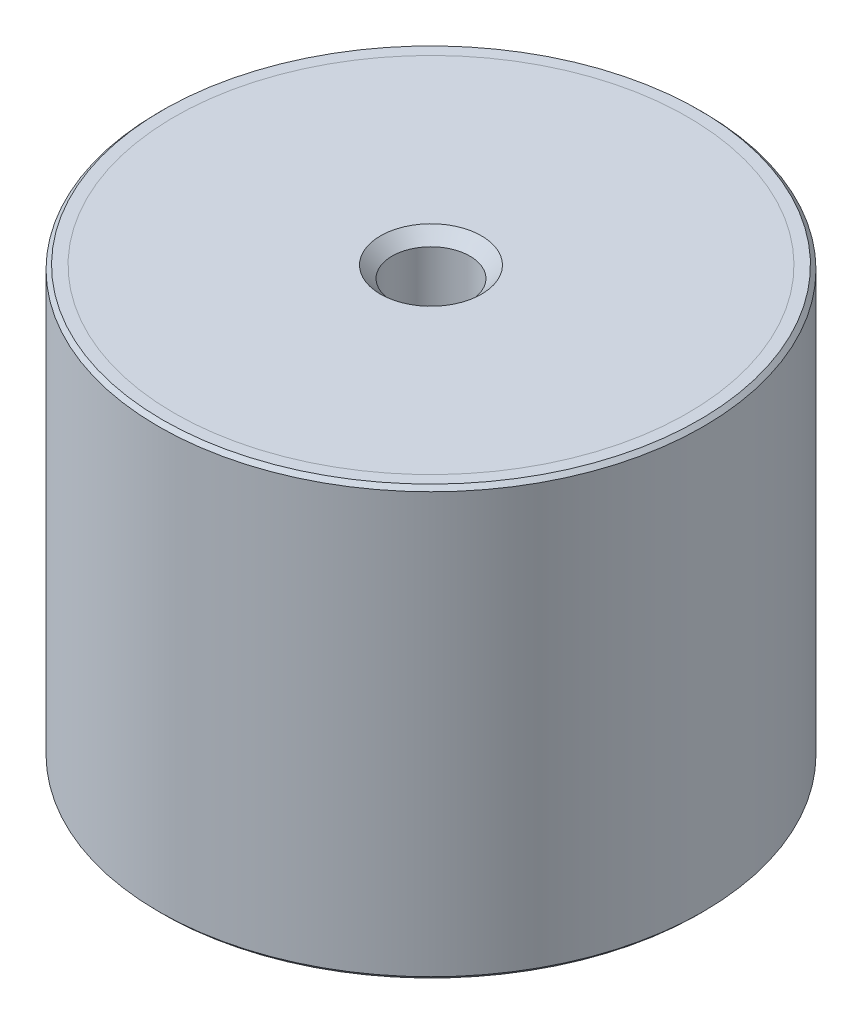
ISO-10303-21;
HEADER;
FILE_DESCRIPTION(('STEP AP214'),'2;1');
FILE_NAME('part.step','',(''),(''),'','','');
FILE_SCHEMA(('AUTOMOTIVE_DESIGN { 1 0 10303 214 1 1 1 1 }'));
ENDSEC;
DATA;
#1=APPLICATION_CONTEXT('core data for automotive mechanical design processes');
#2=APPLICATION_PROTOCOL_DEFINITION('international standard','automotive_design',2000,#1);
#3=PRODUCT_CONTEXT('',#1,'mechanical');
#4=PRODUCT('Part','Part','',(#3));
#5=PRODUCT_RELATED_PRODUCT_CATEGORY('part','',(#4));
#6=PRODUCT_DEFINITION_FORMATION('','',#4);
#7=PRODUCT_DEFINITION_CONTEXT('part definition',#1,'design');
#8=PRODUCT_DEFINITION('design','',#6,#7);
#9=PRODUCT_DEFINITION_SHAPE('','',#8);
#10=(LENGTH_UNIT() NAMED_UNIT(*) SI_UNIT(.MILLI.,.METRE.));
#11=(NAMED_UNIT(*) PLANE_ANGLE_UNIT() SI_UNIT($,.RADIAN.));
#12=(NAMED_UNIT(*) SI_UNIT($,.STERADIAN.) SOLID_ANGLE_UNIT());
#13=UNCERTAINTY_MEASURE_WITH_UNIT(LENGTH_MEASURE(1.E-05),#10,'distance_accuracy_value','');
#14=(GEOMETRIC_REPRESENTATION_CONTEXT(3) GLOBAL_UNCERTAINTY_ASSIGNED_CONTEXT((#13)) GLOBAL_UNIT_ASSIGNED_CONTEXT((#10,
#11,#12)) REPRESENTATION_CONTEXT('',''));
#15=CARTESIAN_POINT('',(0.,0.,0.));
#16=DIRECTION('',(0.,0.,1.));
#17=DIRECTION('',(1.,0.,0.));
#18=AXIS2_PLACEMENT_3D('',#15,#16,#17);
#19=CARTESIAN_POINT('',(0.,-52.,5.));
#20=DIRECTION('',(0.,1.,0.));
#21=DIRECTION('',(0.,0.,1.));
#22=AXIS2_PLACEMENT_3D('',#19,#20,#21);
#23=PLANE('',#22);
#24=CARTESIAN_POINT('',(0.,-52.,0.));
#25=DIRECTION('',(0.,1.,0.));
#26=DIRECTION('',(0.,0.,1.));
#27=AXIS2_PLACEMENT_3D('',#24,#25,#26);
#28=CIRCLE('',#27,33.);
#29=CARTESIAN_POINT('',(0.,-52.,33.));
#30=VERTEX_POINT('',#29);
#31=EDGE_CURVE('P0_E25',#30,#30,#28,.T.);
#32=ORIENTED_EDGE('',*,*,#31,.T.);
#33=EDGE_LOOP('',(#32));
#34=FACE_BOUND('',#33,.T.);
#35=CARTESIAN_POINT('',(0.,-52.,0.));
#36=DIRECTION('',(0.,1.,0.));
#37=DIRECTION('',(0.,0.,1.));
#38=AXIS2_PLACEMENT_3D('',#35,#36,#37);
#39=CIRCLE('',#38,5.);
#40=CARTESIAN_POINT('',(0.,-52.,5.));
#41=VERTEX_POINT('',#40);
#42=EDGE_CURVE('P0_E21',#41,#41,#39,.T.);
#43=ORIENTED_EDGE('',*,*,#42,.F.);
#44=EDGE_LOOP('',(#43));
#45=FACE_BOUND('',#44,.T.);
#46=ADVANCED_FACE('P0_F14',(#34,#45),#23,.T.);
#47=CARTESIAN_POINT('',(0.,16.0340428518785,0.));
#48=DIRECTION('',(0.,1.,0.));
#49=DIRECTION('',(0.,0.,1.));
#50=AXIS2_PLACEMENT_3D('',#47,#48,#49);
#51=CYLINDRICAL_SURFACE('',#50,33.);
#52=CARTESIAN_POINT('',(0.,-53.5,0.));
#53=DIRECTION('',(0.,1.,0.));
#54=DIRECTION('',(0.,0.,1.));
#55=AXIS2_PLACEMENT_3D('',#52,#53,#54);
#56=CIRCLE('',#55,33.);
#57=CARTESIAN_POINT('',(0.,-53.5,33.));
#58=VERTEX_POINT('',#57);
#59=EDGE_CURVE('P0_E29',#58,#58,#56,.T.);
#60=ORIENTED_EDGE('',*,*,#59,.T.);
#61=EDGE_LOOP('',(#60));
#62=FACE_BOUND('',#61,.T.);
#63=ORIENTED_EDGE('',*,*,#31,.F.);
#64=EDGE_LOOP('',(#63));
#65=FACE_BOUND('',#64,.T.);
#66=ADVANCED_FACE('P0_F35',(#62,#65),#51,.T.);
#67=CARTESIAN_POINT('',(0.,-53.5,33.));
#68=DIRECTION('',(0.,-1.,0.));
#69=DIRECTION('',(0.,0.,-1.));
#70=AXIS2_PLACEMENT_3D('',#67,#68,#69);
#71=PLANE('',#70);
#72=CARTESIAN_POINT('',(0.,-53.5,0.));
#73=DIRECTION('',(0.,-1.,0.));
#74=DIRECTION('',(0.,0.,-1.));
#75=AXIS2_PLACEMENT_3D('',#72,#73,#74);
#76=CIRCLE('',#75,6.50000000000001);
#77=CARTESIAN_POINT('',(0.,-53.5,-6.50000000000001));
#78=VERTEX_POINT('',#77);
#79=EDGE_CURVE('P0_E10',#78,#78,#76,.F.);
#80=ORIENTED_EDGE('',*,*,#79,.T.);
#81=EDGE_LOOP('',(#80));
#82=FACE_BOUND('',#81,.T.);
#83=ORIENTED_EDGE('',*,*,#59,.F.);
#84=EDGE_LOOP('',(#83));
#85=FACE_BOUND('',#84,.T.);
#86=ADVANCED_FACE('P0_F38',(#82,#85),#71,.T.);
#87=CARTESIAN_POINT('',(0.,-53.5,0.));
#88=DIRECTION('',(0.,-1.,0.));
#89=DIRECTION('',(0.,0.,-1.));
#90=AXIS2_PLACEMENT_3D('',#87,#88,#89);
#91=CONICAL_SURFACE('',#90,6.50000000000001,0.785398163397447);
#92=ORIENTED_EDGE('',*,*,#42,.T.);
#93=EDGE_LOOP('',(#92));
#94=FACE_BOUND('',#93,.T.);
#95=ORIENTED_EDGE('',*,*,#79,.F.);
#96=EDGE_LOOP('',(#95));
#97=FACE_BOUND('',#96,.T.);
#98=ADVANCED_FACE('P0_F16',(#94,#97),#91,.F.);
#99=CLOSED_SHELL('',(#46,#66,#86,#98));
#100=MANIFOLD_SOLID_BREP('P0_B1',#99);
#101=CARTESIAN_POINT('',(0.,1.5,5.));
#102=DIRECTION('',(0.,1.,0.));
#103=DIRECTION('',(0.,0.,1.));
#104=AXIS2_PLACEMENT_3D('',#101,#102,#103);
#105=PLANE('',#104);
#106=CARTESIAN_POINT('',(0.,1.5,0.));
#107=DIRECTION('',(0.,1.,0.));
#108=DIRECTION('',(0.,0.,1.));
#109=AXIS2_PLACEMENT_3D('',#106,#107,#108);
#110=CIRCLE('',#109,6.50000000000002);
#111=CARTESIAN_POINT('',(0.,1.5,6.50000000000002));
#112=VERTEX_POINT('',#111);
#113=EDGE_CURVE('P1_E10',#112,#112,#110,.F.);
#114=ORIENTED_EDGE('',*,*,#113,.T.);
#115=EDGE_LOOP('',(#114));
#116=FACE_BOUND('',#115,.T.);
#117=CARTESIAN_POINT('',(0.,1.5,0.));
#118=DIRECTION('',(0.,1.,0.));
#119=DIRECTION('',(0.,0.,1.));
#120=AXIS2_PLACEMENT_3D('',#117,#118,#119);
#121=CIRCLE('',#120,33.);
#122=CARTESIAN_POINT('',(0.,1.5,33.));
#123=VERTEX_POINT('',#122);
#124=EDGE_CURVE('P1_E21',#123,#123,#121,.T.);
#125=ORIENTED_EDGE('',*,*,#124,.T.);
#126=EDGE_LOOP('',(#125));
#127=FACE_BOUND('',#126,.T.);
#128=ADVANCED_FACE('P1_F14',(#116,#127),#105,.T.);
#129=CARTESIAN_POINT('',(0.,69.5340428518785,0.));
#130=DIRECTION('',(0.,1.,0.));
#131=DIRECTION('',(0.,0.,1.));
#132=AXIS2_PLACEMENT_3D('',#129,#130,#131);
#133=CYLINDRICAL_SURFACE('',#132,33.);
#134=CARTESIAN_POINT('',(0.,0.,0.));
#135=DIRECTION('',(0.,1.,0.));
#136=DIRECTION('',(0.,0.,1.));
#137=AXIS2_PLACEMENT_3D('',#134,#135,#136);
#138=CIRCLE('',#137,33.);
#139=CARTESIAN_POINT('',(0.,0.,33.));
#140=VERTEX_POINT('',#139);
#141=EDGE_CURVE('P1_E25',#140,#140,#138,.T.);
#142=ORIENTED_EDGE('',*,*,#141,.T.);
#143=EDGE_LOOP('',(#142));
#144=FACE_BOUND('',#143,.T.);
#145=ORIENTED_EDGE('',*,*,#124,.F.);
#146=EDGE_LOOP('',(#145));
#147=FACE_BOUND('',#146,.T.);
#148=ADVANCED_FACE('P1_F44',(#144,#147),#133,.T.);
#149=CARTESIAN_POINT('',(0.,0.,33.));
#150=DIRECTION('',(0.,-1.,0.));
#151=DIRECTION('',(0.,0.,-1.));
#152=AXIS2_PLACEMENT_3D('',#149,#150,#151);
#153=PLANE('',#152);
#154=CARTESIAN_POINT('',(0.,0.,0.));
#155=DIRECTION('',(0.,1.,0.));
#156=DIRECTION('',(0.,0.,1.));
#157=AXIS2_PLACEMENT_3D('',#154,#155,#156);
#158=CIRCLE('',#157,5.);
#159=CARTESIAN_POINT('',(0.,0.,5.));
#160=VERTEX_POINT('',#159);
#161=EDGE_CURVE('P1_E29',#160,#160,#158,.T.);
#162=ORIENTED_EDGE('',*,*,#161,.T.);
#163=EDGE_LOOP('',(#162));
#164=FACE_BOUND('',#163,.T.);
#165=ORIENTED_EDGE('',*,*,#141,.F.);
#166=EDGE_LOOP('',(#165));
#167=FACE_BOUND('',#166,.T.);
#168=ADVANCED_FACE('P1_F35',(#164,#167),#153,.T.);
#169=CARTESIAN_POINT('',(0.,0.,0.));
#170=DIRECTION('',(0.,1.,0.));
#171=DIRECTION('',(0.,0.,1.));
#172=AXIS2_PLACEMENT_3D('',#169,#170,#171);
#173=CONICAL_SURFACE('',#172,5.,0.785398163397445);
#174=ORIENTED_EDGE('',*,*,#113,.F.);
#175=EDGE_LOOP('',(#174));
#176=FACE_BOUND('',#175,.T.);
#177=ORIENTED_EDGE('',*,*,#161,.F.);
#178=EDGE_LOOP('',(#177));
#179=FACE_BOUND('',#178,.T.);
#180=ADVANCED_FACE('P1_F16',(#176,#179),#173,.F.);
#181=CLOSED_SHELL('',(#128,#148,#168,#180));
#182=MANIFOLD_SOLID_BREP('P1_B1',#181);
#183=CARTESIAN_POINT('',(0.,0.,0.));
#184=DIRECTION('',(0.,1.,0.));
#185=DIRECTION('',(0.,0.,1.));
#186=AXIS2_PLACEMENT_3D('',#183,#184,#185);
#187=PLANE('',#186);
#188=CARTESIAN_POINT('',(0.,0.,0.));
#189=DIRECTION('',(0.,1.,0.));
#190=DIRECTION('',(0.,0.,1.));
#191=AXIS2_PLACEMENT_3D('',#188,#189,#190);
#192=CIRCLE('',#191,5.);
#193=CARTESIAN_POINT('',(0.,0.,5.));
#194=VERTEX_POINT('',#193);
#195=EDGE_CURVE('P2_E46',#194,#194,#192,.T.);
#196=ORIENTED_EDGE('',*,*,#195,.F.);
#197=EDGE_LOOP('',(#196));
#198=FACE_BOUND('',#197,.T.);
#199=CARTESIAN_POINT('',(0.,0.,0.));
#200=DIRECTION('',(0.,1.,0.));
#201=DIRECTION('',(0.,0.,1.));
#202=AXIS2_PLACEMENT_3D('',#199,#200,#201);
#203=CIRCLE('',#202,33.);
#204=CARTESIAN_POINT('',(0.,0.,33.));
#205=VERTEX_POINT('',#204);
#206=EDGE_CURVE('P2_E33',#205,#205,#203,.T.);
#207=ORIENTED_EDGE('',*,*,#206,.T.);
#208=EDGE_LOOP('',(#207));
#209=FACE_BOUND('',#208,.T.);
#210=ADVANCED_FACE('P2_F13',(#198,#209),#187,.T.);
#211=CARTESIAN_POINT('',(0.,65.5134936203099,0.));
#212=DIRECTION('',(0.,1.,0.));
#213=DIRECTION('',(0.,0.,1.));
#214=AXIS2_PLACEMENT_3D('',#211,#212,#213);
#215=CYLINDRICAL_SURFACE('',#214,33.);
#216=CARTESIAN_POINT('',(0.,1.5,0.));
#217=DIRECTION('',(0.,1.,0.));
#218=DIRECTION('',(0.,0.,1.));
#219=AXIS2_PLACEMENT_3D('',#216,#217,#218);
#220=CIRCLE('',#219,33.);
#221=CARTESIAN_POINT('',(0.,1.5,33.));
#222=VERTEX_POINT('',#221);
#223=EDGE_CURVE('P2_E36',#222,#222,#220,.T.);
#224=ORIENTED_EDGE('',*,*,#223,.T.);
#225=EDGE_LOOP('',(#224));
#226=FACE_BOUND('',#225,.T.);
#227=ORIENTED_EDGE('',*,*,#206,.F.);
#228=EDGE_LOOP('',(#227));
#229=FACE_BOUND('',#228,.T.);
#230=ADVANCED_FACE('P2_F92',(#226,#229),#215,.F.);
#231=CARTESIAN_POINT('',(0.,1.5,33.));
#232=DIRECTION('',(0.,1.,0.));
#233=DIRECTION('',(0.,0.,1.));
#234=AXIS2_PLACEMENT_3D('',#231,#232,#233);
#235=PLANE('',#234);
#236=CARTESIAN_POINT('',(0.,1.5,0.));
#237=DIRECTION('',(0.,1.,0.));
#238=DIRECTION('',(0.,0.,1.));
#239=AXIS2_PLACEMENT_3D('',#236,#237,#238);
#240=CIRCLE('',#239,34.5);
#241=CARTESIAN_POINT('',(0.,1.5,34.5));
#242=VERTEX_POINT('',#241);
#243=EDGE_CURVE('P2_E9',#242,#242,#240,.T.);
#244=ORIENTED_EDGE('',*,*,#243,.T.);
#245=EDGE_LOOP('',(#244));
#246=FACE_BOUND('',#245,.T.);
#247=ORIENTED_EDGE('',*,*,#223,.F.);
#248=EDGE_LOOP('',(#247));
#249=FACE_BOUND('',#248,.T.);
#250=ADVANCED_FACE('P2_F88',(#246,#249),#235,.T.);
#251=CARTESIAN_POINT('',(0.,65.5134936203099,0.));
#252=DIRECTION('',(0.,1.,0.));
#253=DIRECTION('',(0.,0.,1.));
#254=AXIS2_PLACEMENT_3D('',#251,#252,#253);
#255=CYLINDRICAL_SURFACE('',#254,35.);
#256=CARTESIAN_POINT('',(0.,-53.,0.));
#257=DIRECTION('',(0.,-1.,0.));
#258=DIRECTION('',(0.,0.,-1.));
#259=AXIS2_PLACEMENT_3D('',#256,#257,#258);
#260=CIRCLE('',#259,35.);
#261=CARTESIAN_POINT('',(0.,-53.,-35.));
#262=VERTEX_POINT('',#261);
#263=EDGE_CURVE('P2_E24',#262,#262,#260,.F.);
#264=ORIENTED_EDGE('',*,*,#263,.T.);
#265=EDGE_LOOP('',(#264));
#266=FACE_BOUND('',#265,.T.);
#267=CARTESIAN_POINT('',(0.,0.999999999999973,0.));
#268=DIRECTION('',(0.,1.,0.));
#269=DIRECTION('',(0.,0.,1.));
#270=AXIS2_PLACEMENT_3D('',#267,#268,#269);
#271=CIRCLE('',#270,35.);
#272=CARTESIAN_POINT('',(0.,0.999999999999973,35.));
#273=VERTEX_POINT('',#272);
#274=EDGE_CURVE('P2_E28',#273,#273,#271,.F.);
#275=ORIENTED_EDGE('',*,*,#274,.T.);
#276=EDGE_LOOP('',(#275));
#277=FACE_BOUND('',#276,.T.);
#278=ADVANCED_FACE('P2_F82',(#266,#277),#255,.T.);
#279=CARTESIAN_POINT('',(0.,-53.5,35.));
#280=DIRECTION('',(0.,-1.,0.));
#281=DIRECTION('',(0.,0.,-1.));
#282=AXIS2_PLACEMENT_3D('',#279,#280,#281);
#283=PLANE('',#282);
#284=CARTESIAN_POINT('',(0.,-53.5,0.));
#285=DIRECTION('',(0.,-1.,0.));
#286=DIRECTION('',(0.,0.,-1.));
#287=AXIS2_PLACEMENT_3D('',#284,#285,#286);
#288=CIRCLE('',#287,34.5);
#289=CARTESIAN_POINT('',(0.,-53.5,-34.5));
#290=VERTEX_POINT('',#289);
#291=EDGE_CURVE('P2_E20',#290,#290,#288,.T.);
#292=ORIENTED_EDGE('',*,*,#291,.T.);
#293=EDGE_LOOP('',(#292));
#294=FACE_BOUND('',#293,.T.);
#295=CARTESIAN_POINT('',(0.,-53.5,0.));
#296=DIRECTION('',(0.,1.,0.));
#297=DIRECTION('',(0.,0.,1.));
#298=AXIS2_PLACEMENT_3D('',#295,#296,#297);
#299=CIRCLE('',#298,33.);
#300=CARTESIAN_POINT('',(0.,-53.5,33.));
#301=VERTEX_POINT('',#300);
#302=EDGE_CURVE('P2_E39',#301,#301,#299,.T.);
#303=ORIENTED_EDGE('',*,*,#302,.T.);
#304=EDGE_LOOP('',(#303));
#305=FACE_BOUND('',#304,.T.);
#306=ADVANCED_FACE('P2_F77',(#294,#305),#283,.T.);
#307=CARTESIAN_POINT('',(0.,65.5134936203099,0.));
#308=DIRECTION('',(0.,1.,0.));
#309=DIRECTION('',(0.,0.,1.));
#310=AXIS2_PLACEMENT_3D('',#307,#308,#309);
#311=CYLINDRICAL_SURFACE('',#310,33.);
#312=CARTESIAN_POINT('',(0.,-52.,0.));
#313=DIRECTION('',(0.,1.,0.));
#314=DIRECTION('',(0.,0.,1.));
#315=AXIS2_PLACEMENT_3D('',#312,#313,#314);
#316=CIRCLE('',#315,33.);
#317=CARTESIAN_POINT('',(0.,-52.,33.));
#318=VERTEX_POINT('',#317);
#319=EDGE_CURVE('P2_E42',#318,#318,#316,.T.);
#320=ORIENTED_EDGE('',*,*,#319,.T.);
#321=EDGE_LOOP('',(#320));
#322=FACE_BOUND('',#321,.T.);
#323=ORIENTED_EDGE('',*,*,#302,.F.);
#324=EDGE_LOOP('',(#323));
#325=FACE_BOUND('',#324,.T.);
#326=ADVANCED_FACE('P2_F71',(#322,#325),#311,.F.);
#327=CARTESIAN_POINT('',(0.,-52.,33.));
#328=DIRECTION('',(0.,-1.,0.));
#329=DIRECTION('',(0.,0.,-1.));
#330=AXIS2_PLACEMENT_3D('',#327,#328,#329);
#331=PLANE('',#330);
#332=CARTESIAN_POINT('',(0.,-52.,0.));
#333=DIRECTION('',(0.,-1.,0.));
#334=DIRECTION('',(0.,0.,-1.));
#335=AXIS2_PLACEMENT_3D('',#332,#333,#334);
#336=CIRCLE('',#335,5.);
#337=CARTESIAN_POINT('',(0.,-52.,-5.));
#338=VERTEX_POINT('',#337);
#339=EDGE_CURVE('P2_E52',#338,#338,#336,.T.);
#340=ORIENTED_EDGE('',*,*,#339,.F.);
#341=EDGE_LOOP('',(#340));
#342=FACE_BOUND('',#341,.T.);
#343=ORIENTED_EDGE('',*,*,#319,.F.);
#344=EDGE_LOOP('',(#343));
#345=FACE_BOUND('',#344,.T.);
#346=ADVANCED_FACE('P2_F67',(#342,#345),#331,.T.);
#347=CARTESIAN_POINT('',(0.,-53.,0.));
#348=DIRECTION('',(0.,1.,0.));
#349=DIRECTION('',(0.,0.,1.));
#350=AXIS2_PLACEMENT_3D('',#347,#348,#349);
#351=CONICAL_SURFACE('',#350,35.,0.785398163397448);
#352=ORIENTED_EDGE('',*,*,#291,.F.);
#353=EDGE_LOOP('',(#352));
#354=FACE_BOUND('',#353,.T.);
#355=ORIENTED_EDGE('',*,*,#263,.F.);
#356=EDGE_LOOP('',(#355));
#357=FACE_BOUND('',#356,.T.);
#358=ADVANCED_FACE('P2_F70',(#354,#357),#351,.T.);
#359=CARTESIAN_POINT('',(0.,1.5,0.));
#360=DIRECTION('',(0.,-1.,0.));
#361=DIRECTION('',(0.,0.,-1.));
#362=AXIS2_PLACEMENT_3D('',#359,#360,#361);
#363=CONICAL_SURFACE('',#362,34.5,0.785398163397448);
#364=ORIENTED_EDGE('',*,*,#274,.F.);
#365=EDGE_LOOP('',(#364));
#366=FACE_BOUND('',#365,.T.);
#367=ORIENTED_EDGE('',*,*,#243,.F.);
#368=EDGE_LOOP('',(#367));
#369=FACE_BOUND('',#368,.T.);
#370=ADVANCED_FACE('P2_F15',(#366,#369),#363,.T.);
#371=CARTESIAN_POINT('',(0.,-8.5,0.));
#372=DIRECTION('',(0.,1.,0.));
#373=DIRECTION('',(0.,0.,1.));
#374=AXIS2_PLACEMENT_3D('',#371,#372,#373);
#375=CYLINDRICAL_SURFACE('',#374,5.);
#376=CARTESIAN_POINT('',(0.,-8.5,0.));
#377=DIRECTION('',(0.,1.,0.));
#378=DIRECTION('',(0.,0.,1.));
#379=AXIS2_PLACEMENT_3D('',#376,#377,#378);
#380=CIRCLE('',#379,5.);
#381=CARTESIAN_POINT('',(0.,-8.5,5.));
#382=VERTEX_POINT('',#381);
#383=EDGE_CURVE('P2_E45',#382,#382,#380,.T.);
#384=ORIENTED_EDGE('',*,*,#383,.F.);
#385=EDGE_LOOP('',(#384));
#386=FACE_BOUND('',#385,.T.);
#387=ORIENTED_EDGE('',*,*,#195,.T.);
#388=EDGE_LOOP('',(#387));
#389=FACE_BOUND('',#388,.T.);
#390=ADVANCED_FACE('P2_F108',(#386,#389),#375,.F.);
#391=CARTESIAN_POINT('',(0.,-8.5,0.));
#392=DIRECTION('',(0.,1.,0.));
#393=DIRECTION('',(0.,0.,1.));
#394=AXIS2_PLACEMENT_3D('',#391,#392,#393);
#395=PLANE('',#394);
#396=ORIENTED_EDGE('',*,*,#383,.T.);
#397=EDGE_LOOP('',(#396));
#398=FACE_BOUND('',#397,.T.);
#399=ADVANCED_FACE('P2_F63',(#398),#395,.T.);
#400=CARTESIAN_POINT('',(0.,-43.5,0.));
#401=DIRECTION('',(0.,-1.,0.));
#402=DIRECTION('',(0.,0.,-1.));
#403=AXIS2_PLACEMENT_3D('',#400,#401,#402);
#404=CYLINDRICAL_SURFACE('',#403,5.);
#405=CARTESIAN_POINT('',(0.,-43.5,0.));
#406=DIRECTION('',(0.,-1.,0.));
#407=DIRECTION('',(0.,0.,-1.));
#408=AXIS2_PLACEMENT_3D('',#405,#406,#407);
#409=CIRCLE('',#408,5.);
#410=CARTESIAN_POINT('',(0.,-43.5,-5.));
#411=VERTEX_POINT('',#410);
#412=EDGE_CURVE('P2_E49',#411,#411,#409,.T.);
#413=ORIENTED_EDGE('',*,*,#412,.F.);
#414=EDGE_LOOP('',(#413));
#415=FACE_BOUND('',#414,.T.);
#416=ORIENTED_EDGE('',*,*,#339,.T.);
#417=EDGE_LOOP('',(#416));
#418=FACE_BOUND('',#417,.T.);
#419=ADVANCED_FACE('P2_F60',(#415,#418),#404,.F.);
#420=CARTESIAN_POINT('',(0.,-43.5,0.));
#421=DIRECTION('',(0.,-1.,0.));
#422=DIRECTION('',(0.,0.,-1.));
#423=AXIS2_PLACEMENT_3D('',#420,#421,#422);
#424=PLANE('',#423);
#425=ORIENTED_EDGE('',*,*,#412,.T.);
#426=EDGE_LOOP('',(#425));
#427=FACE_BOUND('',#426,.T.);
#428=ADVANCED_FACE('P2_F58',(#427),#424,.T.);
#429=CLOSED_SHELL('',(#210,#230,#250,#278,#306,#326,#346,#358,#370,#390,#399,#419,#428));
#430=MANIFOLD_SOLID_BREP('P2_B1',#429);
#431=ADVANCED_BREP_SHAPE_REPRESENTATION('',(#18,#100,#182,#430),#14);
#432=SHAPE_DEFINITION_REPRESENTATION(#9,#431);
ENDSEC;
END-ISO-10303-21;
